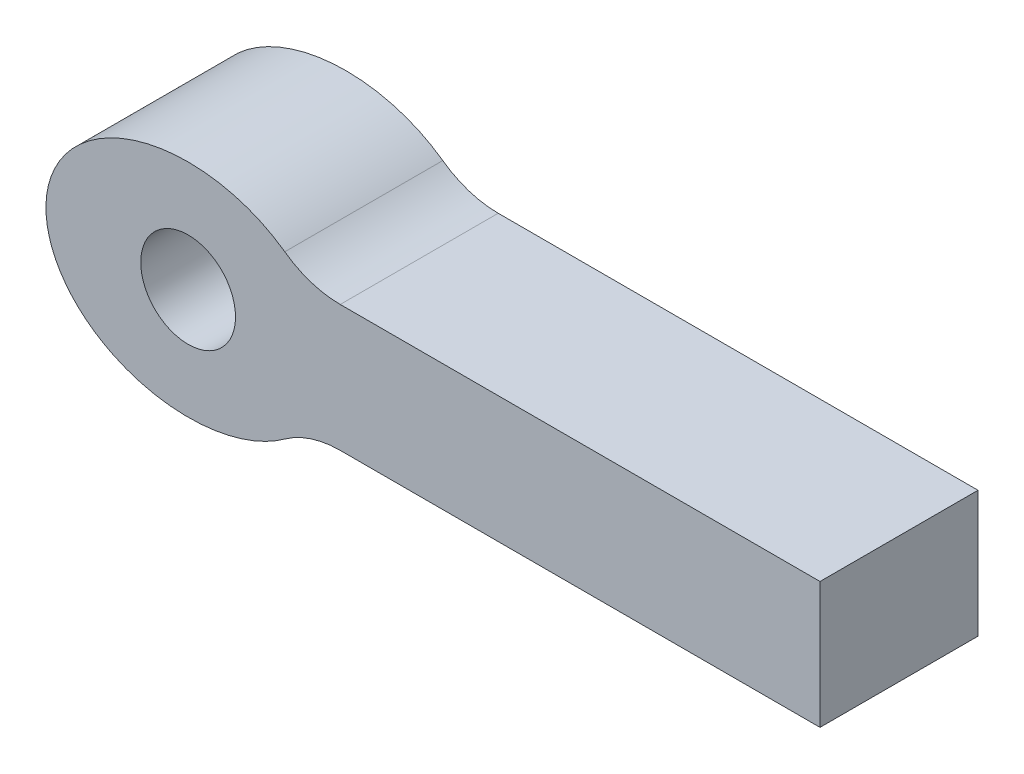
ISO-10303-21;
HEADER;
FILE_DESCRIPTION(('STEP AP214'),'2;1');
FILE_NAME('part.step','',(''),(''),'','','');
FILE_SCHEMA(('AUTOMOTIVE_DESIGN { 1 0 10303 214 1 1 1 1 }'));
ENDSEC;
DATA;
#1=APPLICATION_CONTEXT('core data for automotive mechanical design processes');
#2=APPLICATION_PROTOCOL_DEFINITION('international standard','automotive_design',2000,#1);
#3=PRODUCT_CONTEXT('',#1,'mechanical');
#4=PRODUCT('Part','Part','',(#3));
#5=PRODUCT_RELATED_PRODUCT_CATEGORY('part','',(#4));
#6=PRODUCT_DEFINITION_FORMATION('','',#4);
#7=PRODUCT_DEFINITION_CONTEXT('part definition',#1,'design');
#8=PRODUCT_DEFINITION('design','',#6,#7);
#9=PRODUCT_DEFINITION_SHAPE('','',#8);
#10=(LENGTH_UNIT() NAMED_UNIT(*) SI_UNIT(.MILLI.,.METRE.));
#11=(NAMED_UNIT(*) PLANE_ANGLE_UNIT() SI_UNIT($,.RADIAN.));
#12=(NAMED_UNIT(*) SI_UNIT($,.STERADIAN.) SOLID_ANGLE_UNIT());
#13=UNCERTAINTY_MEASURE_WITH_UNIT(LENGTH_MEASURE(1.E-05),#10,'distance_accuracy_value','');
#14=(GEOMETRIC_REPRESENTATION_CONTEXT(3) GLOBAL_UNCERTAINTY_ASSIGNED_CONTEXT((#13)) GLOBAL_UNIT_ASSIGNED_CONTEXT((#10,
#11,#12)) REPRESENTATION_CONTEXT('',''));
#15=CARTESIAN_POINT('',(0.,0.,0.));
#16=DIRECTION('',(0.,0.,1.));
#17=DIRECTION('',(1.,0.,0.));
#18=AXIS2_PLACEMENT_3D('',#15,#16,#17);
#19=CARTESIAN_POINT('',(0.,0.,2.5));
#20=DIRECTION('',(0.,0.,1.));
#21=DIRECTION('',(1.,0.,0.));
#22=AXIS2_PLACEMENT_3D('',#19,#20,#21);
#23=PLANE('',#22);
#24=CARTESIAN_POINT('',(4.81408800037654,-5.,2.5));
#25=DIRECTION('',(0.,0.,-1.));
#26=DIRECTION('',(1.,0.,0.));
#27=AXIS2_PLACEMENT_3D('',#24,#25,#26);
#28=CIRCLE('',#27,3.);
#29=CARTESIAN_POINT('',(3.05943652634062,-2.56664877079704,2.5));
#30=VERTEX_POINT('',#29);
#31=CARTESIAN_POINT('',(4.81408800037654,-2.,2.5));
#32=VERTEX_POINT('',#31);
#33=EDGE_CURVE('E165',#30,#32,#28,.T.);
#34=ORIENTED_EDGE('',*,*,#33,.T.);
#35=DIRECTION('',(1.,0.,0.));
#36=VECTOR('',#35,1.);
#37=CARTESIAN_POINT('',(20.,-2.,2.5));
#38=LINE('',#37,#36);
#39=CARTESIAN_POINT('',(20.,-2.,2.5));
#40=VERTEX_POINT('',#39);
#41=EDGE_CURVE('E89',#32,#40,#38,.T.);
#42=ORIENTED_EDGE('',*,*,#41,.T.);
#43=DIRECTION('',(0.,1.,0.));
#44=VECTOR('',#43,1.);
#45=CARTESIAN_POINT('',(20.,2.,2.5));
#46=LINE('',#45,#44);
#47=CARTESIAN_POINT('',(20.,2.,2.5));
#48=VERTEX_POINT('',#47);
#49=EDGE_CURVE('E102',#40,#48,#46,.T.);
#50=ORIENTED_EDGE('',*,*,#49,.T.);
#51=DIRECTION('',(-1.,0.,0.));
#52=VECTOR('',#51,1.);
#53=CARTESIAN_POINT('',(4.81408800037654,2.,2.5));
#54=LINE('',#53,#52);
#55=CARTESIAN_POINT('',(4.81408800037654,2.,2.5));
#56=VERTEX_POINT('',#55);
#57=EDGE_CURVE('E96',#48,#56,#54,.T.);
#58=ORIENTED_EDGE('',*,*,#57,.T.);
#59=CARTESIAN_POINT('',(4.81408800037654,5.,2.5));
#60=DIRECTION('',(0.,0.,-1.));
#61=DIRECTION('',(-1.,0.,0.));
#62=AXIS2_PLACEMENT_3D('',#59,#60,#61);
#63=CIRCLE('',#62,3.);
#64=CARTESIAN_POINT('',(3.05943652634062,2.56664877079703,2.5));
#65=VERTEX_POINT('',#64);
#66=EDGE_CURVE('E100',#56,#65,#63,.T.);
#67=ORIENTED_EDGE('',*,*,#66,.T.);
#68=CARTESIAN_POINT('',(0.,0.,2.5));
#69=DIRECTION('',(0.,0.,1.));
#70=DIRECTION('',(1.,0.,0.));
#71=AXIS2_PLACEMENT_3D('',#68,#69,#70);
#72=ELLIPSE('',#71,4.5,3.5);
#73=EDGE_CURVE('E52',#65,#30,#72,.T.);
#74=ORIENTED_EDGE('',*,*,#73,.T.);
#75=EDGE_LOOP('',(#34,#42,#50,#58,#67,#74));
#76=FACE_BOUND('',#75,.T.);
#77=CARTESIAN_POINT('',(0.,0.,2.5));
#78=DIRECTION('',(0.,0.,1.));
#79=DIRECTION('',(1.,0.,0.));
#80=AXIS2_PLACEMENT_3D('',#77,#78,#79);
#81=CIRCLE('',#80,1.5);
#82=CARTESIAN_POINT('',(1.5,0.,2.5));
#83=VERTEX_POINT('',#82);
#84=EDGE_CURVE('E157',#83,#83,#81,.T.);
#85=ORIENTED_EDGE('',*,*,#84,.F.);
#86=EDGE_LOOP('',(#85));
#87=FACE_BOUND('',#86,.T.);
#88=ADVANCED_FACE('F35',(#76,#87),#23,.T.);
#89=CARTESIAN_POINT('',(0.,0.,-2.5));
#90=DIRECTION('',(0.,0.,1.));
#91=DIRECTION('',(1.,0.,0.));
#92=AXIS2_PLACEMENT_3D('',#89,#90,#91);
#93=PLANE('',#92);
#94=CARTESIAN_POINT('',(4.81408800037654,-5.,-2.5));
#95=DIRECTION('',(0.,0.,-1.));
#96=DIRECTION('',(1.,0.,0.));
#97=AXIS2_PLACEMENT_3D('',#94,#95,#96);
#98=CIRCLE('',#97,3.);
#99=CARTESIAN_POINT('',(3.05943652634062,-2.56664877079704,-2.5));
#100=VERTEX_POINT('',#99);
#101=CARTESIAN_POINT('',(4.81408800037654,-2.,-2.5));
#102=VERTEX_POINT('',#101);
#103=EDGE_CURVE('E121',#100,#102,#98,.T.);
#104=ORIENTED_EDGE('',*,*,#103,.F.);
#105=CARTESIAN_POINT('',(0.,0.,-2.5));
#106=DIRECTION('',(0.,0.,1.));
#107=DIRECTION('',(1.,0.,0.));
#108=AXIS2_PLACEMENT_3D('',#105,#106,#107);
#109=ELLIPSE('',#108,4.5,3.5);
#110=CARTESIAN_POINT('',(3.05943652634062,2.56664877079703,-2.5));
#111=VERTEX_POINT('',#110);
#112=EDGE_CURVE('E81',#111,#100,#109,.T.);
#113=ORIENTED_EDGE('',*,*,#112,.F.);
#114=CARTESIAN_POINT('',(4.81408800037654,5.,-2.5));
#115=DIRECTION('',(0.,0.,-1.));
#116=DIRECTION('',(-1.,0.,0.));
#117=AXIS2_PLACEMENT_3D('',#114,#115,#116);
#118=CIRCLE('',#117,3.);
#119=CARTESIAN_POINT('',(4.81408800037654,2.,-2.5));
#120=VERTEX_POINT('',#119);
#121=EDGE_CURVE('E75',#120,#111,#118,.T.);
#122=ORIENTED_EDGE('',*,*,#121,.F.);
#123=DIRECTION('',(-1.,0.,0.));
#124=VECTOR('',#123,1.);
#125=CARTESIAN_POINT('',(4.81408800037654,2.,-2.5));
#126=LINE('',#125,#124);
#127=CARTESIAN_POINT('',(20.,2.,-2.5));
#128=VERTEX_POINT('',#127);
#129=EDGE_CURVE('E110',#128,#120,#126,.T.);
#130=ORIENTED_EDGE('',*,*,#129,.F.);
#131=DIRECTION('',(0.,1.,0.));
#132=VECTOR('',#131,1.);
#133=CARTESIAN_POINT('',(20.,2.,-2.5));
#134=LINE('',#133,#132);
#135=CARTESIAN_POINT('',(20.,-2.,-2.5));
#136=VERTEX_POINT('',#135);
#137=EDGE_CURVE('E172',#136,#128,#134,.T.);
#138=ORIENTED_EDGE('',*,*,#137,.F.);
#139=DIRECTION('',(1.,0.,0.));
#140=VECTOR('',#139,1.);
#141=CARTESIAN_POINT('',(20.,-2.,-2.5));
#142=LINE('',#141,#140);
#143=EDGE_CURVE('E170',#102,#136,#142,.T.);
#144=ORIENTED_EDGE('',*,*,#143,.F.);
#145=EDGE_LOOP('',(#104,#113,#122,#130,#138,#144));
#146=FACE_BOUND('',#145,.T.);
#147=CARTESIAN_POINT('',(0.,0.,-2.5));
#148=DIRECTION('',(0.,0.,1.));
#149=DIRECTION('',(1.,0.,0.));
#150=AXIS2_PLACEMENT_3D('',#147,#148,#149);
#151=CIRCLE('',#150,1.5);
#152=CARTESIAN_POINT('',(1.5,0.,-2.5));
#153=VERTEX_POINT('',#152);
#154=EDGE_CURVE('E160',#153,#153,#151,.T.);
#155=ORIENTED_EDGE('',*,*,#154,.T.);
#156=EDGE_LOOP('',(#155));
#157=FACE_BOUND('',#156,.T.);
#158=ADVANCED_FACE('F129',(#146,#157),#93,.F.);
#159=CARTESIAN_POINT('',(4.81408800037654,-5.,2.5));
#160=DIRECTION('',(0.,0.,-1.));
#161=DIRECTION('',(-1.,0.,0.));
#162=AXIS2_PLACEMENT_3D('',#159,#160,#161);
#163=CYLINDRICAL_SURFACE('',#162,3.);
#164=ORIENTED_EDGE('',*,*,#103,.T.);
#165=DIRECTION('',(0.,0.,-1.));
#166=VECTOR('',#165,1.);
#167=CARTESIAN_POINT('',(4.81408800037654,-2.,2.5));
#168=LINE('',#167,#166);
#169=EDGE_CURVE('E11',#32,#102,#168,.T.);
#170=ORIENTED_EDGE('',*,*,#169,.F.);
#171=ORIENTED_EDGE('',*,*,#33,.F.);
#172=DIRECTION('',(0.,0.,-1.));
#173=VECTOR('',#172,1.);
#174=CARTESIAN_POINT('',(3.05943652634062,-2.56664877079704,2.5));
#175=LINE('',#174,#173);
#176=EDGE_CURVE('E116',#30,#100,#175,.T.);
#177=ORIENTED_EDGE('',*,*,#176,.T.);
#178=EDGE_LOOP('',(#164,#170,#171,#177));
#179=FACE_BOUND('',#178,.T.);
#180=ADVANCED_FACE('F37',(#179),#163,.F.);
#181=CARTESIAN_POINT('',(20.,-2.,2.5));
#182=DIRECTION('',(0.,1.,0.));
#183=DIRECTION('',(0.,0.,1.));
#184=AXIS2_PLACEMENT_3D('',#181,#182,#183);
#185=PLANE('',#184);
#186=ORIENTED_EDGE('',*,*,#143,.T.);
#187=DIRECTION('',(0.,0.,-1.));
#188=VECTOR('',#187,1.);
#189=CARTESIAN_POINT('',(20.,-2.,2.5));
#190=LINE('',#189,#188);
#191=EDGE_CURVE('E44',#40,#136,#190,.T.);
#192=ORIENTED_EDGE('',*,*,#191,.F.);
#193=ORIENTED_EDGE('',*,*,#41,.F.);
#194=ORIENTED_EDGE('',*,*,#169,.T.);
#195=EDGE_LOOP('',(#186,#192,#193,#194));
#196=FACE_BOUND('',#195,.T.);
#197=ADVANCED_FACE('F137',(#196),#185,.F.);
#198=CARTESIAN_POINT('',(20.,2.,2.5));
#199=DIRECTION('',(-1.,0.,0.));
#200=DIRECTION('',(0.,0.,1.));
#201=AXIS2_PLACEMENT_3D('',#198,#199,#200);
#202=PLANE('',#201);
#203=ORIENTED_EDGE('',*,*,#137,.T.);
#204=DIRECTION('',(0.,0.,-1.));
#205=VECTOR('',#204,1.);
#206=CARTESIAN_POINT('',(20.,2.,2.5));
#207=LINE('',#206,#205);
#208=EDGE_CURVE('E111',#48,#128,#207,.T.);
#209=ORIENTED_EDGE('',*,*,#208,.F.);
#210=ORIENTED_EDGE('',*,*,#49,.F.);
#211=ORIENTED_EDGE('',*,*,#191,.T.);
#212=EDGE_LOOP('',(#203,#209,#210,#211));
#213=FACE_BOUND('',#212,.T.);
#214=ADVANCED_FACE('F135',(#213),#202,.F.);
#215=CARTESIAN_POINT('',(4.81408800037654,2.,2.5));
#216=DIRECTION('',(0.,-1.,0.));
#217=DIRECTION('',(0.,0.,-1.));
#218=AXIS2_PLACEMENT_3D('',#215,#216,#217);
#219=PLANE('',#218);
#220=ORIENTED_EDGE('',*,*,#129,.T.);
#221=DIRECTION('',(0.,0.,-1.));
#222=VECTOR('',#221,1.);
#223=CARTESIAN_POINT('',(4.81408800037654,2.,2.5));
#224=LINE('',#223,#222);
#225=EDGE_CURVE('E107',#56,#120,#224,.T.);
#226=ORIENTED_EDGE('',*,*,#225,.F.);
#227=ORIENTED_EDGE('',*,*,#57,.F.);
#228=ORIENTED_EDGE('',*,*,#208,.T.);
#229=EDGE_LOOP('',(#220,#226,#227,#228));
#230=FACE_BOUND('',#229,.T.);
#231=ADVANCED_FACE('F108',(#230),#219,.F.);
#232=CARTESIAN_POINT('',(4.81408800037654,5.,2.5));
#233=DIRECTION('',(0.,0.,-1.));
#234=DIRECTION('',(-1.,0.,0.));
#235=AXIS2_PLACEMENT_3D('',#232,#233,#234);
#236=CYLINDRICAL_SURFACE('',#235,3.);
#237=ORIENTED_EDGE('',*,*,#121,.T.);
#238=DIRECTION('',(0.,0.,-1.));
#239=VECTOR('',#238,1.);
#240=CARTESIAN_POINT('',(3.05943652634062,2.56664877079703,2.5));
#241=LINE('',#240,#239);
#242=EDGE_CURVE('E112',#65,#111,#241,.T.);
#243=ORIENTED_EDGE('',*,*,#242,.F.);
#244=ORIENTED_EDGE('',*,*,#66,.F.);
#245=ORIENTED_EDGE('',*,*,#225,.T.);
#246=EDGE_LOOP('',(#237,#243,#244,#245));
#247=FACE_BOUND('',#246,.T.);
#248=ADVANCED_FACE('F114',(#247),#236,.F.);
#249=DIRECTION('',(0.,0.,-1.));
#250=VECTOR('',#249,1.);
#251=SURFACE_OF_LINEAR_EXTRUSION('',#72,#250);
#252=ORIENTED_EDGE('',*,*,#112,.T.);
#253=ORIENTED_EDGE('',*,*,#176,.F.);
#254=ORIENTED_EDGE('',*,*,#73,.F.);
#255=ORIENTED_EDGE('',*,*,#242,.T.);
#256=EDGE_LOOP('',(#252,#253,#254,#255));
#257=FACE_BOUND('',#256,.T.);
#258=ADVANCED_FACE('F124',(#257),#251,.F.);
#259=CARTESIAN_POINT('',(0.,0.,2.5));
#260=DIRECTION('',(0.,0.,-1.));
#261=DIRECTION('',(-1.,0.,0.));
#262=AXIS2_PLACEMENT_3D('',#259,#260,#261);
#263=CYLINDRICAL_SURFACE('',#262,1.5);
#264=ORIENTED_EDGE('',*,*,#84,.T.);
#265=EDGE_LOOP('',(#264));
#266=FACE_BOUND('',#265,.T.);
#267=ORIENTED_EDGE('',*,*,#154,.F.);
#268=EDGE_LOOP('',(#267));
#269=FACE_BOUND('',#268,.T.);
#270=ADVANCED_FACE('F128',(#266,#269),#263,.F.);
#271=CLOSED_SHELL('',(#88,#158,#180,#197,#214,#231,#248,#258,#270));
#272=MANIFOLD_SOLID_BREP('B2',#271);
#273=ADVANCED_BREP_SHAPE_REPRESENTATION('',(#18,#272),#14);
#274=SHAPE_DEFINITION_REPRESENTATION(#9,#273);
ENDSEC;
END-ISO-10303-21;
